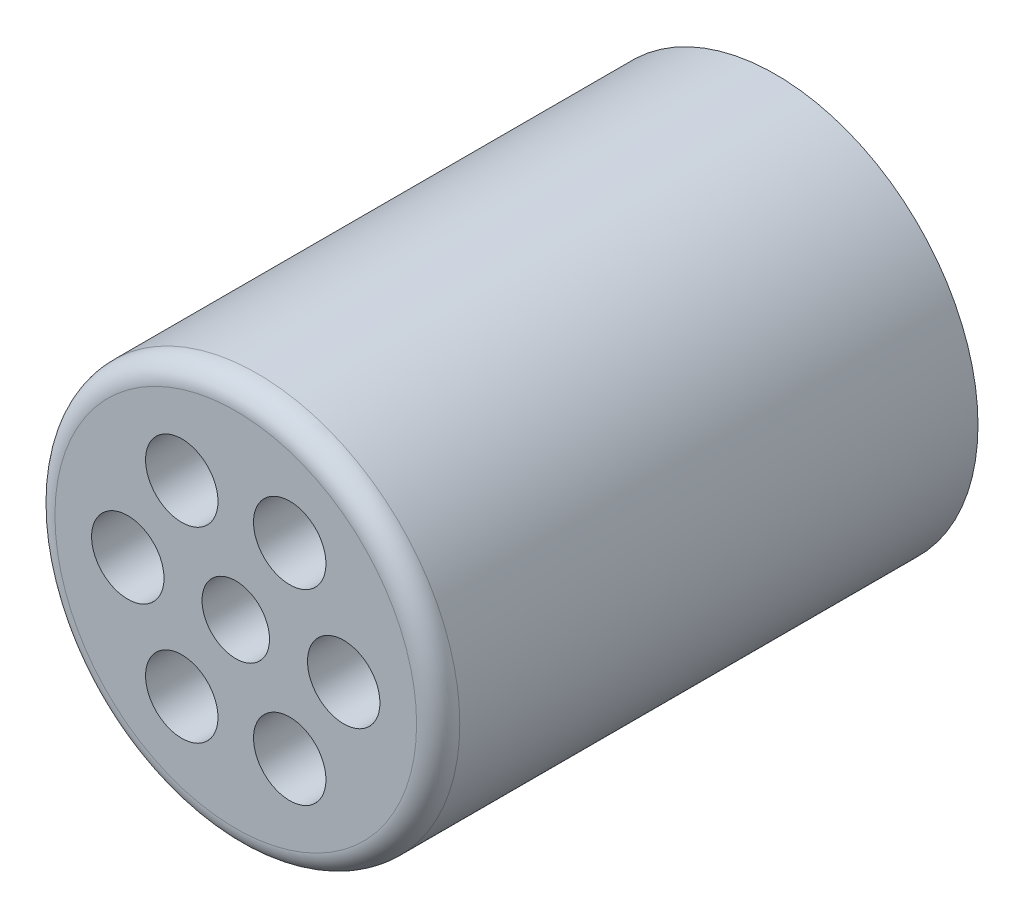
from build123d import *

# Parameters (mm, degrees)
SKETCH1_R          = 4.7625
EXTRUDE1_DEPTH     = 12.7
SKETCH2_R          = 0.79375
SKETCH2_R_2        = 0.852064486
CUT_EXTRUDE1_DEPTH = 6.35
FILLET1_R          = 0.508


with BuildPart() as part:
    # Sketch1 → Extrude1 (new body)
    with BuildSketch(Plane.XY):
        Circle(SKETCH1_R)
    extrude(amount=EXTRUDE1_DEPTH)

    # Sketch2 → Cut-Extrude1 (cut)
    with BuildSketch(Plane.XY.offset(12.7)):
        Circle(SKETCH2_R)
        with Locations((2.54, 0)):
            Circle(SKETCH2_R_2)
        with Locations((1.27, -2.199704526)):
            Circle(SKETCH2_R_2)
        with Locations((-1.27, -2.199704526)):
            Circle(SKETCH2_R_2)
        with Locations((-2.54, 0)):
            Circle(SKETCH2_R_2)
        with Locations((-1.27, 2.199704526)):
            Circle(SKETCH2_R_2)
        with Locations((1.27, 2.199704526)):
            Circle(SKETCH2_R_2)
    extrude(amount=-CUT_EXTRUDE1_DEPTH, mode=Mode.SUBTRACT)

    # Fillet1
    fillet1_edges = [part.edges().sort_by_distance(p)[0] for p in [
        (-4.7625, 0, 12.7),
    ]]
    fillet(fillet1_edges, radius=FILLET1_R)


solid = part.part
